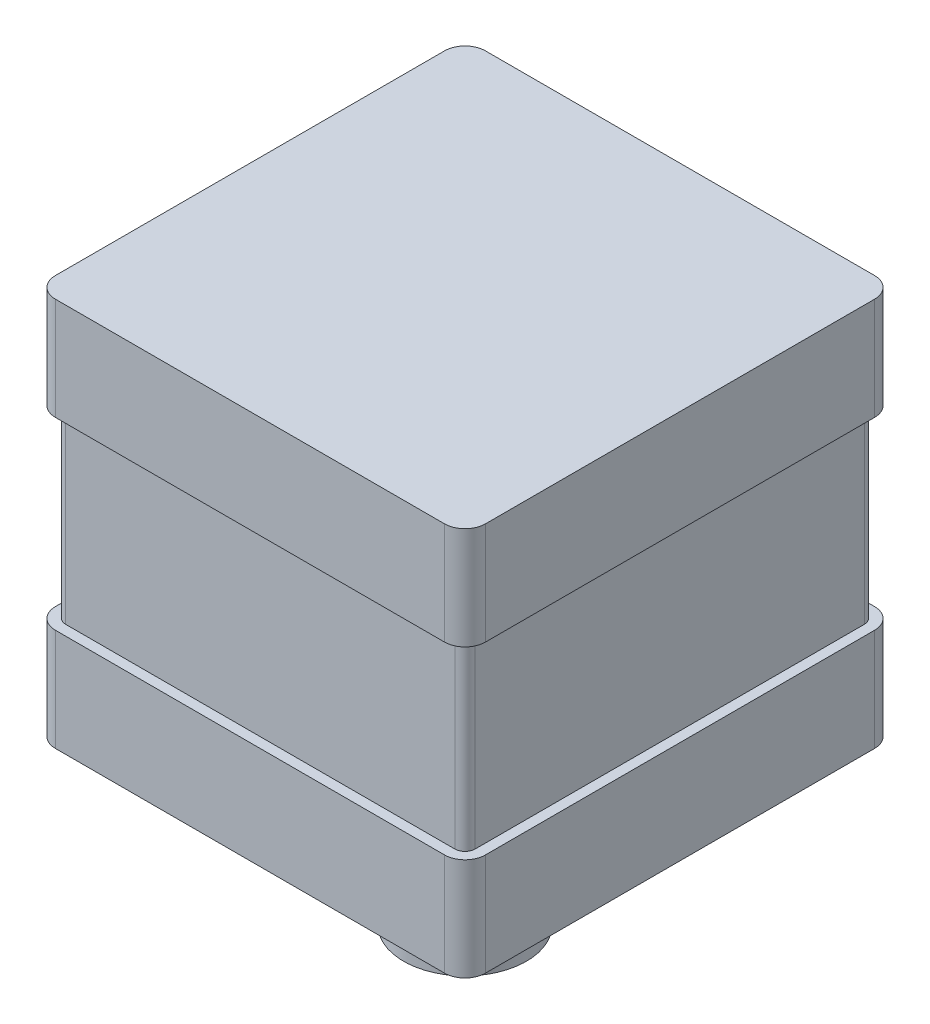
ISO-10303-21;
HEADER;
FILE_DESCRIPTION(('STEP AP214'),'2;1');
FILE_NAME('part.step','',(''),(''),'','','');
FILE_SCHEMA(('AUTOMOTIVE_DESIGN { 1 0 10303 214 1 1 1 1 }'));
ENDSEC;
DATA;
#1=APPLICATION_CONTEXT('core data for automotive mechanical design processes');
#2=APPLICATION_PROTOCOL_DEFINITION('international standard','automotive_design',2000,#1);
#3=PRODUCT_CONTEXT('',#1,'mechanical');
#4=PRODUCT('Part','Part','',(#3));
#5=PRODUCT_RELATED_PRODUCT_CATEGORY('part','',(#4));
#6=PRODUCT_DEFINITION_FORMATION('','',#4);
#7=PRODUCT_DEFINITION_CONTEXT('part definition',#1,'design');
#8=PRODUCT_DEFINITION('design','',#6,#7);
#9=PRODUCT_DEFINITION_SHAPE('','',#8);
#10=(LENGTH_UNIT() NAMED_UNIT(*) SI_UNIT(.MILLI.,.METRE.));
#11=(NAMED_UNIT(*) PLANE_ANGLE_UNIT() SI_UNIT($,.RADIAN.));
#12=(NAMED_UNIT(*) SI_UNIT($,.STERADIAN.) SOLID_ANGLE_UNIT());
#13=UNCERTAINTY_MEASURE_WITH_UNIT(LENGTH_MEASURE(1.E-05),#10,'distance_accuracy_value','');
#14=(GEOMETRIC_REPRESENTATION_CONTEXT(3) GLOBAL_UNCERTAINTY_ASSIGNED_CONTEXT((#13)) GLOBAL_UNIT_ASSIGNED_CONTEXT((#10,
#11,#12)) REPRESENTATION_CONTEXT('',''));
#15=CARTESIAN_POINT('',(0.,0.,0.));
#16=DIRECTION('',(0.,0.,1.));
#17=DIRECTION('',(1.,0.,0.));
#18=AXIS2_PLACEMENT_3D('',#15,#16,#17);
#19=CARTESIAN_POINT('',(-19.,10.,-19.));
#20=DIRECTION('',(0.,-1.,0.));
#21=DIRECTION('',(0.,0.,-1.));
#22=AXIS2_PLACEMENT_3D('',#19,#20,#21);
#23=CYLINDRICAL_SURFACE('',#22,2.);
#24=CARTESIAN_POINT('',(-19.,0.,-19.));
#25=DIRECTION('',(0.,1.,0.));
#26=DIRECTION('',(0.,0.,-1.));
#27=AXIS2_PLACEMENT_3D('',#24,#25,#26);
#28=CIRCLE('',#27,2.);
#29=CARTESIAN_POINT('',(-19.,0.,-21.));
#30=VERTEX_POINT('',#29);
#31=CARTESIAN_POINT('',(-21.,0.,-19.));
#32=VERTEX_POINT('',#31);
#33=EDGE_CURVE('E336',#30,#32,#28,.T.);
#34=ORIENTED_EDGE('',*,*,#33,.T.);
#35=DIRECTION('',(0.,-1.,0.));
#36=VECTOR('',#35,1.);
#37=CARTESIAN_POINT('',(-21.,10.,-19.));
#38=LINE('',#37,#36);
#39=CARTESIAN_POINT('',(-21.,10.,-19.));
#40=VERTEX_POINT('',#39);
#41=EDGE_CURVE('E60',#40,#32,#38,.T.);
#42=ORIENTED_EDGE('',*,*,#41,.F.);
#43=CARTESIAN_POINT('',(-19.,10.,-19.));
#44=DIRECTION('',(0.,1.,0.));
#45=DIRECTION('',(0.,0.,-1.));
#46=AXIS2_PLACEMENT_3D('',#43,#44,#45);
#47=CIRCLE('',#46,2.);
#48=CARTESIAN_POINT('',(-19.,10.,-21.));
#49=VERTEX_POINT('',#48);
#50=EDGE_CURVE('E337',#49,#40,#47,.T.);
#51=ORIENTED_EDGE('',*,*,#50,.F.);
#52=DIRECTION('',(0.,-1.,0.));
#53=VECTOR('',#52,1.);
#54=CARTESIAN_POINT('',(-19.,10.,-21.));
#55=LINE('',#54,#53);
#56=EDGE_CURVE('E363',#49,#30,#55,.T.);
#57=ORIENTED_EDGE('',*,*,#56,.T.);
#58=EDGE_LOOP('',(#34,#42,#51,#57));
#59=FACE_BOUND('',#58,.T.);
#60=ADVANCED_FACE('F51',(#59),#23,.T.);
#61=CARTESIAN_POINT('',(-21.,10.,19.));
#62=DIRECTION('',(1.,0.,0.));
#63=DIRECTION('',(0.,0.,-1.));
#64=AXIS2_PLACEMENT_3D('',#61,#62,#63);
#65=PLANE('',#64);
#66=DIRECTION('',(0.,0.,1.));
#67=VECTOR('',#66,1.);
#68=CARTESIAN_POINT('',(-21.,0.,19.));
#69=LINE('',#68,#67);
#70=CARTESIAN_POINT('',(-21.,0.,19.));
#71=VERTEX_POINT('',#70);
#72=EDGE_CURVE('E367',#32,#71,#69,.T.);
#73=ORIENTED_EDGE('',*,*,#72,.T.);
#74=DIRECTION('',(0.,-1.,0.));
#75=VECTOR('',#74,1.);
#76=CARTESIAN_POINT('',(-21.,10.,19.));
#77=LINE('',#76,#75);
#78=CARTESIAN_POINT('',(-21.,10.,19.));
#79=VERTEX_POINT('',#78);
#80=EDGE_CURVE('E410',#79,#71,#77,.T.);
#81=ORIENTED_EDGE('',*,*,#80,.F.);
#82=DIRECTION('',(0.,0.,1.));
#83=VECTOR('',#82,1.);
#84=CARTESIAN_POINT('',(-21.,10.,19.));
#85=LINE('',#84,#83);
#86=EDGE_CURVE('E341',#40,#79,#85,.T.);
#87=ORIENTED_EDGE('',*,*,#86,.F.);
#88=ORIENTED_EDGE('',*,*,#41,.T.);
#89=EDGE_LOOP('',(#73,#81,#87,#88));
#90=FACE_BOUND('',#89,.T.);
#91=ADVANCED_FACE('F418',(#90),#65,.F.);
#92=CARTESIAN_POINT('',(-19.,10.,19.));
#93=DIRECTION('',(0.,-1.,0.));
#94=DIRECTION('',(0.,0.,-1.));
#95=AXIS2_PLACEMENT_3D('',#92,#93,#94);
#96=CYLINDRICAL_SURFACE('',#95,2.);
#97=CARTESIAN_POINT('',(-19.,0.,19.));
#98=DIRECTION('',(0.,1.,0.));
#99=DIRECTION('',(0.,0.,-1.));
#100=AXIS2_PLACEMENT_3D('',#97,#98,#99);
#101=CIRCLE('',#100,2.);
#102=CARTESIAN_POINT('',(-19.,0.,21.));
#103=VERTEX_POINT('',#102);
#104=EDGE_CURVE('E370',#71,#103,#101,.T.);
#105=ORIENTED_EDGE('',*,*,#104,.T.);
#106=DIRECTION('',(0.,-1.,0.));
#107=VECTOR('',#106,1.);
#108=CARTESIAN_POINT('',(-19.,10.,21.));
#109=LINE('',#108,#107);
#110=CARTESIAN_POINT('',(-19.,10.,21.));
#111=VERTEX_POINT('',#110);
#112=EDGE_CURVE('E406',#111,#103,#109,.T.);
#113=ORIENTED_EDGE('',*,*,#112,.F.);
#114=CARTESIAN_POINT('',(-19.,10.,19.));
#115=DIRECTION('',(0.,1.,0.));
#116=DIRECTION('',(0.,0.,-1.));
#117=AXIS2_PLACEMENT_3D('',#114,#115,#116);
#118=CIRCLE('',#117,2.);
#119=EDGE_CURVE('E345',#79,#111,#118,.T.);
#120=ORIENTED_EDGE('',*,*,#119,.F.);
#121=ORIENTED_EDGE('',*,*,#80,.T.);
#122=EDGE_LOOP('',(#105,#113,#120,#121));
#123=FACE_BOUND('',#122,.T.);
#124=ADVANCED_FACE('F433',(#123),#96,.T.);
#125=CARTESIAN_POINT('',(-19.,10.,21.));
#126=DIRECTION('',(0.,0.,-1.));
#127=DIRECTION('',(-1.,0.,0.));
#128=AXIS2_PLACEMENT_3D('',#125,#126,#127);
#129=PLANE('',#128);
#130=DIRECTION('',(1.,0.,0.));
#131=VECTOR('',#130,1.);
#132=CARTESIAN_POINT('',(-19.,0.,21.));
#133=LINE('',#132,#131);
#134=CARTESIAN_POINT('',(19.,0.,21.));
#135=VERTEX_POINT('',#134);
#136=EDGE_CURVE('E373',#103,#135,#133,.T.);
#137=ORIENTED_EDGE('',*,*,#136,.T.);
#138=DIRECTION('',(0.,-1.,0.));
#139=VECTOR('',#138,1.);
#140=CARTESIAN_POINT('',(19.,10.,21.));
#141=LINE('',#140,#139);
#142=CARTESIAN_POINT('',(19.,10.,21.));
#143=VERTEX_POINT('',#142);
#144=EDGE_CURVE('E402',#143,#135,#141,.T.);
#145=ORIENTED_EDGE('',*,*,#144,.F.);
#146=DIRECTION('',(1.,0.,0.));
#147=VECTOR('',#146,1.);
#148=CARTESIAN_POINT('',(-19.,10.,21.));
#149=LINE('',#148,#147);
#150=EDGE_CURVE('E348',#111,#143,#149,.T.);
#151=ORIENTED_EDGE('',*,*,#150,.F.);
#152=ORIENTED_EDGE('',*,*,#112,.T.);
#153=EDGE_LOOP('',(#137,#145,#151,#152));
#154=FACE_BOUND('',#153,.T.);
#155=ADVANCED_FACE('F437',(#154),#129,.F.);
#156=CARTESIAN_POINT('',(19.,10.,19.));
#157=DIRECTION('',(0.,-1.,0.));
#158=DIRECTION('',(0.,0.,-1.));
#159=AXIS2_PLACEMENT_3D('',#156,#157,#158);
#160=CYLINDRICAL_SURFACE('',#159,2.);
#161=CARTESIAN_POINT('',(19.,0.,19.));
#162=DIRECTION('',(0.,1.,0.));
#163=DIRECTION('',(0.,0.,1.));
#164=AXIS2_PLACEMENT_3D('',#161,#162,#163);
#165=CIRCLE('',#164,2.);
#166=CARTESIAN_POINT('',(21.,0.,19.));
#167=VERTEX_POINT('',#166);
#168=EDGE_CURVE('E376',#135,#167,#165,.T.);
#169=ORIENTED_EDGE('',*,*,#168,.T.);
#170=DIRECTION('',(0.,-1.,0.));
#171=VECTOR('',#170,1.);
#172=CARTESIAN_POINT('',(21.,10.,19.));
#173=LINE('',#172,#171);
#174=CARTESIAN_POINT('',(21.,10.,19.));
#175=VERTEX_POINT('',#174);
#176=EDGE_CURVE('E398',#175,#167,#173,.T.);
#177=ORIENTED_EDGE('',*,*,#176,.F.);
#178=CARTESIAN_POINT('',(19.,10.,19.));
#179=DIRECTION('',(0.,1.,0.));
#180=DIRECTION('',(0.,0.,1.));
#181=AXIS2_PLACEMENT_3D('',#178,#179,#180);
#182=CIRCLE('',#181,2.);
#183=EDGE_CURVE('E351',#143,#175,#182,.T.);
#184=ORIENTED_EDGE('',*,*,#183,.F.);
#185=ORIENTED_EDGE('',*,*,#144,.T.);
#186=EDGE_LOOP('',(#169,#177,#184,#185));
#187=FACE_BOUND('',#186,.T.);
#188=ADVANCED_FACE('F456',(#187),#160,.T.);
#189=CARTESIAN_POINT('',(21.,10.,19.));
#190=DIRECTION('',(-1.,0.,0.));
#191=DIRECTION('',(0.,0.,1.));
#192=AXIS2_PLACEMENT_3D('',#189,#190,#191);
#193=PLANE('',#192);
#194=DIRECTION('',(0.,0.,-1.));
#195=VECTOR('',#194,1.);
#196=CARTESIAN_POINT('',(21.,0.,19.));
#197=LINE('',#196,#195);
#198=CARTESIAN_POINT('',(21.,0.,-19.));
#199=VERTEX_POINT('',#198);
#200=EDGE_CURVE('E379',#167,#199,#197,.T.);
#201=ORIENTED_EDGE('',*,*,#200,.T.);
#202=DIRECTION('',(0.,-1.,0.));
#203=VECTOR('',#202,1.);
#204=CARTESIAN_POINT('',(21.,10.,-19.));
#205=LINE('',#204,#203);
#206=CARTESIAN_POINT('',(21.,10.,-19.));
#207=VERTEX_POINT('',#206);
#208=EDGE_CURVE('E394',#207,#199,#205,.T.);
#209=ORIENTED_EDGE('',*,*,#208,.F.);
#210=DIRECTION('',(0.,0.,-1.));
#211=VECTOR('',#210,1.);
#212=CARTESIAN_POINT('',(21.,10.,19.));
#213=LINE('',#212,#211);
#214=EDGE_CURVE('E354',#175,#207,#213,.T.);
#215=ORIENTED_EDGE('',*,*,#214,.F.);
#216=ORIENTED_EDGE('',*,*,#176,.T.);
#217=EDGE_LOOP('',(#201,#209,#215,#216));
#218=FACE_BOUND('',#217,.T.);
#219=ADVANCED_FACE('F453',(#218),#193,.F.);
#220=CARTESIAN_POINT('',(19.,10.,-19.));
#221=DIRECTION('',(0.,-1.,0.));
#222=DIRECTION('',(0.,0.,-1.));
#223=AXIS2_PLACEMENT_3D('',#220,#221,#222);
#224=CYLINDRICAL_SURFACE('',#223,2.);
#225=CARTESIAN_POINT('',(19.,0.,-19.));
#226=DIRECTION('',(0.,1.,0.));
#227=DIRECTION('',(0.,0.,1.));
#228=AXIS2_PLACEMENT_3D('',#225,#226,#227);
#229=CIRCLE('',#228,2.);
#230=CARTESIAN_POINT('',(19.,0.,-21.));
#231=VERTEX_POINT('',#230);
#232=EDGE_CURVE('E382',#199,#231,#229,.T.);
#233=ORIENTED_EDGE('',*,*,#232,.T.);
#234=DIRECTION('',(0.,-1.,0.));
#235=VECTOR('',#234,1.);
#236=CARTESIAN_POINT('',(19.,10.,-21.));
#237=LINE('',#236,#235);
#238=CARTESIAN_POINT('',(19.,10.,-21.));
#239=VERTEX_POINT('',#238);
#240=EDGE_CURVE('E390',#239,#231,#237,.T.);
#241=ORIENTED_EDGE('',*,*,#240,.F.);
#242=CARTESIAN_POINT('',(19.,10.,-19.));
#243=DIRECTION('',(0.,1.,0.));
#244=DIRECTION('',(0.,0.,1.));
#245=AXIS2_PLACEMENT_3D('',#242,#243,#244);
#246=CIRCLE('',#245,2.);
#247=EDGE_CURVE('E357',#207,#239,#246,.T.);
#248=ORIENTED_EDGE('',*,*,#247,.F.);
#249=ORIENTED_EDGE('',*,*,#208,.T.);
#250=EDGE_LOOP('',(#233,#241,#248,#249));
#251=FACE_BOUND('',#250,.T.);
#252=ADVANCED_FACE('F449',(#251),#224,.T.);
#253=CARTESIAN_POINT('',(-19.,10.,-21.));
#254=DIRECTION('',(0.,0.,1.));
#255=DIRECTION('',(1.,0.,0.));
#256=AXIS2_PLACEMENT_3D('',#253,#254,#255);
#257=PLANE('',#256);
#258=DIRECTION('',(-1.,0.,0.));
#259=VECTOR('',#258,1.);
#260=CARTESIAN_POINT('',(-19.,0.,-21.));
#261=LINE('',#260,#259);
#262=EDGE_CURVE('E342',#231,#30,#261,.T.);
#263=ORIENTED_EDGE('',*,*,#262,.T.);
#264=ORIENTED_EDGE('',*,*,#56,.F.);
#265=DIRECTION('',(-1.,0.,0.));
#266=VECTOR('',#265,1.);
#267=CARTESIAN_POINT('',(-19.,10.,-21.));
#268=LINE('',#267,#266);
#269=EDGE_CURVE('E360',#239,#49,#268,.T.);
#270=ORIENTED_EDGE('',*,*,#269,.F.);
#271=ORIENTED_EDGE('',*,*,#240,.T.);
#272=EDGE_LOOP('',(#263,#264,#270,#271));
#273=FACE_BOUND('',#272,.T.);
#274=ADVANCED_FACE('F447',(#273),#257,.F.);
#275=CARTESIAN_POINT('',(-19.,10.,-19.));
#276=DIRECTION('',(0.,-1.,0.));
#277=DIRECTION('',(0.,0.,-1.));
#278=AXIS2_PLACEMENT_3D('',#275,#276,#277);
#279=PLANE('',#278);
#280=ORIENTED_EDGE('',*,*,#50,.T.);
#281=ORIENTED_EDGE('',*,*,#86,.T.);
#282=ORIENTED_EDGE('',*,*,#119,.T.);
#283=ORIENTED_EDGE('',*,*,#150,.T.);
#284=ORIENTED_EDGE('',*,*,#183,.T.);
#285=ORIENTED_EDGE('',*,*,#214,.T.);
#286=ORIENTED_EDGE('',*,*,#247,.T.);
#287=ORIENTED_EDGE('',*,*,#269,.T.);
#288=EDGE_LOOP('',(#280,#281,#282,#283,#284,#285,#286,#287));
#289=FACE_BOUND('',#288,.T.);
#290=ADVANCED_FACE('F441',(#289),#279,.F.);
#291=CARTESIAN_POINT('',(-19.,0.,-19.));
#292=DIRECTION('',(0.,-1.,0.));
#293=DIRECTION('',(0.,0.,-1.));
#294=AXIS2_PLACEMENT_3D('',#291,#292,#293);
#295=PLANE('',#294);
#296=CARTESIAN_POINT('',(-19.,0.,19.));
#297=DIRECTION('',(0.,-1.,0.));
#298=DIRECTION('',(0.,0.,1.));
#299=AXIS2_PLACEMENT_3D('',#296,#297,#298);
#300=CIRCLE('',#299,1.);
#301=CARTESIAN_POINT('',(-19.,0.,20.));
#302=VERTEX_POINT('',#301);
#303=CARTESIAN_POINT('',(-20.,0.,19.));
#304=VERTEX_POINT('',#303);
#305=EDGE_CURVE('E67',#302,#304,#300,.T.);
#306=ORIENTED_EDGE('',*,*,#305,.F.);
#307=DIRECTION('',(-1.,0.,0.));
#308=VECTOR('',#307,1.);
#309=CARTESIAN_POINT('',(-19.,0.,20.));
#310=LINE('',#309,#308);
#311=CARTESIAN_POINT('',(19.,0.,20.));
#312=VERTEX_POINT('',#311);
#313=EDGE_CURVE('E71',#312,#302,#310,.T.);
#314=ORIENTED_EDGE('',*,*,#313,.F.);
#315=CARTESIAN_POINT('',(19.,0.,19.));
#316=DIRECTION('',(0.,-1.,0.));
#317=DIRECTION('',(0.,0.,-1.));
#318=AXIS2_PLACEMENT_3D('',#315,#316,#317);
#319=CIRCLE('',#318,1.);
#320=CARTESIAN_POINT('',(20.,0.,19.));
#321=VERTEX_POINT('',#320);
#322=EDGE_CURVE('E300',#321,#312,#319,.T.);
#323=ORIENTED_EDGE('',*,*,#322,.F.);
#324=DIRECTION('',(0.,0.,1.));
#325=VECTOR('',#324,1.);
#326=CARTESIAN_POINT('',(20.,0.,-19.));
#327=LINE('',#326,#325);
#328=CARTESIAN_POINT('',(20.,0.,-19.));
#329=VERTEX_POINT('',#328);
#330=EDGE_CURVE('E296',#329,#321,#327,.T.);
#331=ORIENTED_EDGE('',*,*,#330,.F.);
#332=CARTESIAN_POINT('',(19.,0.,-19.));
#333=DIRECTION('',(0.,-1.,0.));
#334=DIRECTION('',(0.,0.,-1.));
#335=AXIS2_PLACEMENT_3D('',#332,#333,#334);
#336=CIRCLE('',#335,1.);
#337=CARTESIAN_POINT('',(19.,0.,-20.));
#338=VERTEX_POINT('',#337);
#339=EDGE_CURVE('E292',#338,#329,#336,.T.);
#340=ORIENTED_EDGE('',*,*,#339,.F.);
#341=DIRECTION('',(1.,0.,0.));
#342=VECTOR('',#341,1.);
#343=CARTESIAN_POINT('',(-19.,0.,-20.));
#344=LINE('',#343,#342);
#345=CARTESIAN_POINT('',(-19.,0.,-20.));
#346=VERTEX_POINT('',#345);
#347=EDGE_CURVE('E288',#346,#338,#344,.T.);
#348=ORIENTED_EDGE('',*,*,#347,.F.);
#349=CARTESIAN_POINT('',(-19.,0.,-19.));
#350=DIRECTION('',(0.,-1.,0.));
#351=DIRECTION('',(0.,0.,1.));
#352=AXIS2_PLACEMENT_3D('',#349,#350,#351);
#353=CIRCLE('',#352,1.);
#354=CARTESIAN_POINT('',(-20.,0.,-19.));
#355=VERTEX_POINT('',#354);
#356=EDGE_CURVE('E284',#355,#346,#353,.T.);
#357=ORIENTED_EDGE('',*,*,#356,.F.);
#358=DIRECTION('',(0.,0.,-1.));
#359=VECTOR('',#358,1.);
#360=CARTESIAN_POINT('',(-20.,0.,-19.));
#361=LINE('',#360,#359);
#362=EDGE_CURVE('E242',#304,#355,#361,.T.);
#363=ORIENTED_EDGE('',*,*,#362,.F.);
#364=EDGE_LOOP('',(#306,#314,#323,#331,#340,#348,#357,#363));
#365=FACE_BOUND('',#364,.T.);
#366=ORIENTED_EDGE('',*,*,#33,.F.);
#367=ORIENTED_EDGE('',*,*,#262,.F.);
#368=ORIENTED_EDGE('',*,*,#232,.F.);
#369=ORIENTED_EDGE('',*,*,#200,.F.);
#370=ORIENTED_EDGE('',*,*,#168,.F.);
#371=ORIENTED_EDGE('',*,*,#136,.F.);
#372=ORIENTED_EDGE('',*,*,#104,.F.);
#373=ORIENTED_EDGE('',*,*,#72,.F.);
#374=EDGE_LOOP('',(#366,#367,#368,#369,#370,#371,#372,#373));
#375=FACE_BOUND('',#374,.T.);
#376=ADVANCED_FACE('F426',(#365,#375),#295,.T.);
#377=CARTESIAN_POINT('',(-19.,-18.,19.));
#378=DIRECTION('',(0.,1.,0.));
#379=DIRECTION('',(0.,0.,1.));
#380=AXIS2_PLACEMENT_3D('',#377,#378,#379);
#381=CYLINDRICAL_SURFACE('',#380,1.);
#382=ORIENTED_EDGE('',*,*,#305,.T.);
#383=DIRECTION('',(0.,1.,0.));
#384=VECTOR('',#383,1.);
#385=CARTESIAN_POINT('',(-20.,-18.,19.));
#386=LINE('',#385,#384);
#387=CARTESIAN_POINT('',(-20.,-18.,19.));
#388=VERTEX_POINT('',#387);
#389=EDGE_CURVE('E332',#388,#304,#386,.T.);
#390=ORIENTED_EDGE('',*,*,#389,.F.);
#391=CARTESIAN_POINT('',(-19.,-18.,19.));
#392=DIRECTION('',(0.,-1.,0.));
#393=DIRECTION('',(0.,0.,1.));
#394=AXIS2_PLACEMENT_3D('',#391,#392,#393);
#395=CIRCLE('',#394,1.);
#396=CARTESIAN_POINT('',(-19.,-18.,20.));
#397=VERTEX_POINT('',#396);
#398=EDGE_CURVE('E248',#397,#388,#395,.T.);
#399=ORIENTED_EDGE('',*,*,#398,.F.);
#400=DIRECTION('',(0.,1.,0.));
#401=VECTOR('',#400,1.);
#402=CARTESIAN_POINT('',(-19.,-18.,20.));
#403=LINE('',#402,#401);
#404=EDGE_CURVE('E279',#397,#302,#403,.T.);
#405=ORIENTED_EDGE('',*,*,#404,.T.);
#406=EDGE_LOOP('',(#382,#390,#399,#405));
#407=FACE_BOUND('',#406,.T.);
#408=ADVANCED_FACE('F522',(#407),#381,.T.);
#409=CARTESIAN_POINT('',(-20.,-18.,-19.));
#410=DIRECTION('',(1.,0.,0.));
#411=DIRECTION('',(0.,0.,-1.));
#412=AXIS2_PLACEMENT_3D('',#409,#410,#411);
#413=PLANE('',#412);
#414=ORIENTED_EDGE('',*,*,#362,.T.);
#415=DIRECTION('',(0.,1.,0.));
#416=VECTOR('',#415,1.);
#417=CARTESIAN_POINT('',(-20.,-18.,-19.));
#418=LINE('',#417,#416);
#419=CARTESIAN_POINT('',(-20.,-18.,-19.));
#420=VERTEX_POINT('',#419);
#421=EDGE_CURVE('E328',#420,#355,#418,.T.);
#422=ORIENTED_EDGE('',*,*,#421,.F.);
#423=DIRECTION('',(0.,0.,-1.));
#424=VECTOR('',#423,1.);
#425=CARTESIAN_POINT('',(-20.,-18.,-19.));
#426=LINE('',#425,#424);
#427=EDGE_CURVE('E252',#388,#420,#426,.T.);
#428=ORIENTED_EDGE('',*,*,#427,.F.);
#429=ORIENTED_EDGE('',*,*,#389,.T.);
#430=EDGE_LOOP('',(#414,#422,#428,#429));
#431=FACE_BOUND('',#430,.T.);
#432=ADVANCED_FACE('F531',(#431),#413,.F.);
#433=CARTESIAN_POINT('',(-19.,-18.,-19.));
#434=DIRECTION('',(0.,1.,0.));
#435=DIRECTION('',(0.,0.,1.));
#436=AXIS2_PLACEMENT_3D('',#433,#434,#435);
#437=CYLINDRICAL_SURFACE('',#436,1.);
#438=ORIENTED_EDGE('',*,*,#356,.T.);
#439=DIRECTION('',(0.,1.,0.));
#440=VECTOR('',#439,1.);
#441=CARTESIAN_POINT('',(-19.,-18.,-20.));
#442=LINE('',#441,#440);
#443=CARTESIAN_POINT('',(-19.,-18.,-20.));
#444=VERTEX_POINT('',#443);
#445=EDGE_CURVE('E324',#444,#346,#442,.T.);
#446=ORIENTED_EDGE('',*,*,#445,.F.);
#447=CARTESIAN_POINT('',(-19.,-18.,-19.));
#448=DIRECTION('',(0.,-1.,0.));
#449=DIRECTION('',(0.,0.,1.));
#450=AXIS2_PLACEMENT_3D('',#447,#448,#449);
#451=CIRCLE('',#450,1.);
#452=EDGE_CURVE('E256',#420,#444,#451,.T.);
#453=ORIENTED_EDGE('',*,*,#452,.F.);
#454=ORIENTED_EDGE('',*,*,#421,.T.);
#455=EDGE_LOOP('',(#438,#446,#453,#454));
#456=FACE_BOUND('',#455,.T.);
#457=ADVANCED_FACE('F541',(#456),#437,.T.);
#458=CARTESIAN_POINT('',(-19.,-18.,-20.));
#459=DIRECTION('',(0.,0.,1.));
#460=DIRECTION('',(1.,0.,0.));
#461=AXIS2_PLACEMENT_3D('',#458,#459,#460);
#462=PLANE('',#461);
#463=ORIENTED_EDGE('',*,*,#347,.T.);
#464=DIRECTION('',(0.,1.,0.));
#465=VECTOR('',#464,1.);
#466=CARTESIAN_POINT('',(19.,-18.,-20.));
#467=LINE('',#466,#465);
#468=CARTESIAN_POINT('',(19.,-18.,-20.));
#469=VERTEX_POINT('',#468);
#470=EDGE_CURVE('E320',#469,#338,#467,.T.);
#471=ORIENTED_EDGE('',*,*,#470,.F.);
#472=DIRECTION('',(1.,0.,0.));
#473=VECTOR('',#472,1.);
#474=CARTESIAN_POINT('',(-19.,-18.,-20.));
#475=LINE('',#474,#473);
#476=EDGE_CURVE('E260',#444,#469,#475,.T.);
#477=ORIENTED_EDGE('',*,*,#476,.F.);
#478=ORIENTED_EDGE('',*,*,#445,.T.);
#479=EDGE_LOOP('',(#463,#471,#477,#478));
#480=FACE_BOUND('',#479,.T.);
#481=ADVANCED_FACE('F551',(#480),#462,.F.);
#482=CARTESIAN_POINT('',(19.,-18.,-19.));
#483=DIRECTION('',(0.,1.,0.));
#484=DIRECTION('',(0.,0.,1.));
#485=AXIS2_PLACEMENT_3D('',#482,#483,#484);
#486=CYLINDRICAL_SURFACE('',#485,1.);
#487=ORIENTED_EDGE('',*,*,#339,.T.);
#488=DIRECTION('',(0.,1.,0.));
#489=VECTOR('',#488,1.);
#490=CARTESIAN_POINT('',(20.,-18.,-19.));
#491=LINE('',#490,#489);
#492=CARTESIAN_POINT('',(20.,-18.,-19.));
#493=VERTEX_POINT('',#492);
#494=EDGE_CURVE('E316',#493,#329,#491,.T.);
#495=ORIENTED_EDGE('',*,*,#494,.F.);
#496=CARTESIAN_POINT('',(19.,-18.,-19.));
#497=DIRECTION('',(0.,-1.,0.));
#498=DIRECTION('',(0.,0.,-1.));
#499=AXIS2_PLACEMENT_3D('',#496,#497,#498);
#500=CIRCLE('',#499,1.);
#501=EDGE_CURVE('E264',#469,#493,#500,.T.);
#502=ORIENTED_EDGE('',*,*,#501,.F.);
#503=ORIENTED_EDGE('',*,*,#470,.T.);
#504=EDGE_LOOP('',(#487,#495,#502,#503));
#505=FACE_BOUND('',#504,.T.);
#506=ADVANCED_FACE('F561',(#505),#486,.T.);
#507=CARTESIAN_POINT('',(20.,-18.,-19.));
#508=DIRECTION('',(-1.,0.,0.));
#509=DIRECTION('',(0.,0.,1.));
#510=AXIS2_PLACEMENT_3D('',#507,#508,#509);
#511=PLANE('',#510);
#512=ORIENTED_EDGE('',*,*,#330,.T.);
#513=DIRECTION('',(0.,1.,0.));
#514=VECTOR('',#513,1.);
#515=CARTESIAN_POINT('',(20.,-18.,19.));
#516=LINE('',#515,#514);
#517=CARTESIAN_POINT('',(20.,-18.,19.));
#518=VERTEX_POINT('',#517);
#519=EDGE_CURVE('E312',#518,#321,#516,.T.);
#520=ORIENTED_EDGE('',*,*,#519,.F.);
#521=DIRECTION('',(0.,0.,1.));
#522=VECTOR('',#521,1.);
#523=CARTESIAN_POINT('',(20.,-18.,-19.));
#524=LINE('',#523,#522);
#525=EDGE_CURVE('E268',#493,#518,#524,.T.);
#526=ORIENTED_EDGE('',*,*,#525,.F.);
#527=ORIENTED_EDGE('',*,*,#494,.T.);
#528=EDGE_LOOP('',(#512,#520,#526,#527));
#529=FACE_BOUND('',#528,.T.);
#530=ADVANCED_FACE('F571',(#529),#511,.F.);
#531=CARTESIAN_POINT('',(19.,-18.,19.));
#532=DIRECTION('',(0.,1.,0.));
#533=DIRECTION('',(0.,0.,1.));
#534=AXIS2_PLACEMENT_3D('',#531,#532,#533);
#535=CYLINDRICAL_SURFACE('',#534,1.);
#536=ORIENTED_EDGE('',*,*,#322,.T.);
#537=DIRECTION('',(0.,1.,0.));
#538=VECTOR('',#537,1.);
#539=CARTESIAN_POINT('',(19.,-18.,20.));
#540=LINE('',#539,#538);
#541=CARTESIAN_POINT('',(19.,-18.,20.));
#542=VERTEX_POINT('',#541);
#543=EDGE_CURVE('E308',#542,#312,#540,.T.);
#544=ORIENTED_EDGE('',*,*,#543,.F.);
#545=CARTESIAN_POINT('',(19.,-18.,19.));
#546=DIRECTION('',(0.,-1.,0.));
#547=DIRECTION('',(0.,0.,-1.));
#548=AXIS2_PLACEMENT_3D('',#545,#546,#547);
#549=CIRCLE('',#548,1.);
#550=EDGE_CURVE('E272',#518,#542,#549,.T.);
#551=ORIENTED_EDGE('',*,*,#550,.F.);
#552=ORIENTED_EDGE('',*,*,#519,.T.);
#553=EDGE_LOOP('',(#536,#544,#551,#552));
#554=FACE_BOUND('',#553,.T.);
#555=ADVANCED_FACE('F581',(#554),#535,.T.);
#556=CARTESIAN_POINT('',(-19.,-18.,20.));
#557=DIRECTION('',(0.,0.,-1.));
#558=DIRECTION('',(-1.,0.,0.));
#559=AXIS2_PLACEMENT_3D('',#556,#557,#558);
#560=PLANE('',#559);
#561=ORIENTED_EDGE('',*,*,#313,.T.);
#562=ORIENTED_EDGE('',*,*,#404,.F.);
#563=DIRECTION('',(-1.,0.,0.));
#564=VECTOR('',#563,1.);
#565=CARTESIAN_POINT('',(-19.,-18.,20.));
#566=LINE('',#565,#564);
#567=EDGE_CURVE('E276',#542,#397,#566,.T.);
#568=ORIENTED_EDGE('',*,*,#567,.F.);
#569=ORIENTED_EDGE('',*,*,#543,.T.);
#570=EDGE_LOOP('',(#561,#562,#568,#569));
#571=FACE_BOUND('',#570,.T.);
#572=ADVANCED_FACE('F591',(#571),#560,.F.);
#573=CARTESIAN_POINT('',(-19.,-18.,19.));
#574=DIRECTION('',(0.,-1.,0.));
#575=DIRECTION('',(0.,0.,-1.));
#576=AXIS2_PLACEMENT_3D('',#573,#574,#575);
#577=PLANE('',#576);
#578=CARTESIAN_POINT('',(-19.,-18.,19.));
#579=DIRECTION('',(0.,-1.,0.));
#580=DIRECTION('',(0.,0.,-1.));
#581=AXIS2_PLACEMENT_3D('',#578,#579,#580);
#582=CIRCLE('',#581,2.);
#583=CARTESIAN_POINT('',(-19.,-18.,21.));
#584=VERTEX_POINT('',#583);
#585=CARTESIAN_POINT('',(-21.,-18.,19.));
#586=VERTEX_POINT('',#585);
#587=EDGE_CURVE('E237',#584,#586,#582,.T.);
#588=ORIENTED_EDGE('',*,*,#587,.F.);
#589=DIRECTION('',(-1.,0.,0.));
#590=VECTOR('',#589,1.);
#591=CARTESIAN_POINT('',(19.,-18.,21.));
#592=LINE('',#591,#590);
#593=CARTESIAN_POINT('',(19.,-18.,21.));
#594=VERTEX_POINT('',#593);
#595=EDGE_CURVE('E233',#594,#584,#592,.T.);
#596=ORIENTED_EDGE('',*,*,#595,.F.);
#597=CARTESIAN_POINT('',(19.,-18.,19.));
#598=DIRECTION('',(0.,-1.,0.));
#599=DIRECTION('',(0.,0.,-1.));
#600=AXIS2_PLACEMENT_3D('',#597,#598,#599);
#601=CIRCLE('',#600,2.);
#602=CARTESIAN_POINT('',(21.,-18.,19.));
#603=VERTEX_POINT('',#602);
#604=EDGE_CURVE('E961',#603,#594,#601,.T.);
#605=ORIENTED_EDGE('',*,*,#604,.F.);
#606=DIRECTION('',(0.,0.,1.));
#607=VECTOR('',#606,1.);
#608=CARTESIAN_POINT('',(21.,-18.,-19.));
#609=LINE('',#608,#607);
#610=CARTESIAN_POINT('',(21.,-18.,-19.));
#611=VERTEX_POINT('',#610);
#612=EDGE_CURVE('E958',#611,#603,#609,.T.);
#613=ORIENTED_EDGE('',*,*,#612,.F.);
#614=CARTESIAN_POINT('',(19.,-18.,-19.));
#615=DIRECTION('',(0.,-1.,0.));
#616=DIRECTION('',(0.,0.,-1.));
#617=AXIS2_PLACEMENT_3D('',#614,#615,#616);
#618=CIRCLE('',#617,2.);
#619=CARTESIAN_POINT('',(19.,-18.,-21.));
#620=VERTEX_POINT('',#619);
#621=EDGE_CURVE('E955',#620,#611,#618,.T.);
#622=ORIENTED_EDGE('',*,*,#621,.F.);
#623=DIRECTION('',(1.,0.,0.));
#624=VECTOR('',#623,1.);
#625=CARTESIAN_POINT('',(-19.,-18.,-21.));
#626=LINE('',#625,#624);
#627=CARTESIAN_POINT('',(-19.,-18.,-21.));
#628=VERTEX_POINT('',#627);
#629=EDGE_CURVE('E952',#628,#620,#626,.T.);
#630=ORIENTED_EDGE('',*,*,#629,.F.);
#631=CARTESIAN_POINT('',(-19.,-18.,-19.));
#632=DIRECTION('',(0.,-1.,0.));
#633=DIRECTION('',(0.,0.,-1.));
#634=AXIS2_PLACEMENT_3D('',#631,#632,#633);
#635=CIRCLE('',#634,2.);
#636=CARTESIAN_POINT('',(-21.,-18.,-19.));
#637=VERTEX_POINT('',#636);
#638=EDGE_CURVE('E949',#637,#628,#635,.T.);
#639=ORIENTED_EDGE('',*,*,#638,.F.);
#640=DIRECTION('',(0.,0.,-1.));
#641=VECTOR('',#640,1.);
#642=CARTESIAN_POINT('',(-21.,-18.,19.));
#643=LINE('',#642,#641);
#644=EDGE_CURVE('E946',#586,#637,#643,.T.);
#645=ORIENTED_EDGE('',*,*,#644,.F.);
#646=EDGE_LOOP('',(#588,#596,#605,#613,#622,#630,#639,#645));
#647=FACE_BOUND('',#646,.T.);
#648=ORIENTED_EDGE('',*,*,#567,.T.);
#649=ORIENTED_EDGE('',*,*,#398,.T.);
#650=ORIENTED_EDGE('',*,*,#427,.T.);
#651=ORIENTED_EDGE('',*,*,#452,.T.);
#652=ORIENTED_EDGE('',*,*,#476,.T.);
#653=ORIENTED_EDGE('',*,*,#501,.T.);
#654=ORIENTED_EDGE('',*,*,#525,.T.);
#655=ORIENTED_EDGE('',*,*,#550,.T.);
#656=EDGE_LOOP('',(#648,#649,#650,#651,#652,#653,#654,#655));
#657=FACE_BOUND('',#656,.T.);
#658=ADVANCED_FACE('F601',(#647,#657),#577,.F.);
#659=CARTESIAN_POINT('',(-19.,-28.,19.));
#660=DIRECTION('',(0.,1.,0.));
#661=DIRECTION('',(0.,0.,1.));
#662=AXIS2_PLACEMENT_3D('',#659,#660,#661);
#663=CYLINDRICAL_SURFACE('',#662,2.);
#664=ORIENTED_EDGE('',*,*,#587,.T.);
#665=DIRECTION('',(0.,1.,0.));
#666=VECTOR('',#665,1.);
#667=CARTESIAN_POINT('',(-21.,-28.,19.));
#668=LINE('',#667,#666);
#669=CARTESIAN_POINT('',(-21.,-28.,19.));
#670=VERTEX_POINT('',#669);
#671=EDGE_CURVE('E215',#670,#586,#668,.T.);
#672=ORIENTED_EDGE('',*,*,#671,.F.);
#673=CARTESIAN_POINT('',(-19.,-28.,19.));
#674=DIRECTION('',(0.,-1.,0.));
#675=DIRECTION('',(0.,0.,-1.));
#676=AXIS2_PLACEMENT_3D('',#673,#674,#675);
#677=CIRCLE('',#676,2.);
#678=CARTESIAN_POINT('',(-19.,-28.,21.));
#679=VERTEX_POINT('',#678);
#680=EDGE_CURVE('E223',#679,#670,#677,.T.);
#681=ORIENTED_EDGE('',*,*,#680,.F.);
#682=DIRECTION('',(0.,1.,0.));
#683=VECTOR('',#682,1.);
#684=CARTESIAN_POINT('',(-19.,-28.,21.));
#685=LINE('',#684,#683);
#686=EDGE_CURVE('E943',#679,#584,#685,.T.);
#687=ORIENTED_EDGE('',*,*,#686,.T.);
#688=EDGE_LOOP('',(#664,#672,#681,#687));
#689=FACE_BOUND('',#688,.T.);
#690=ADVANCED_FACE('F235',(#689),#663,.T.);
#691=CARTESIAN_POINT('',(-21.,-28.,19.));
#692=DIRECTION('',(1.,0.,0.));
#693=DIRECTION('',(0.,0.,-1.));
#694=AXIS2_PLACEMENT_3D('',#691,#692,#693);
#695=PLANE('',#694);
#696=ORIENTED_EDGE('',*,*,#644,.T.);
#697=DIRECTION('',(0.,1.,0.));
#698=VECTOR('',#697,1.);
#699=CARTESIAN_POINT('',(-21.,-28.,-19.));
#700=LINE('',#699,#698);
#701=CARTESIAN_POINT('',(-21.,-28.,-19.));
#702=VERTEX_POINT('',#701);
#703=EDGE_CURVE('E218',#702,#637,#700,.T.);
#704=ORIENTED_EDGE('',*,*,#703,.F.);
#705=DIRECTION('',(0.,0.,-1.));
#706=VECTOR('',#705,1.);
#707=CARTESIAN_POINT('',(-21.,-28.,19.));
#708=LINE('',#707,#706);
#709=EDGE_CURVE('E211',#670,#702,#708,.T.);
#710=ORIENTED_EDGE('',*,*,#709,.F.);
#711=ORIENTED_EDGE('',*,*,#671,.T.);
#712=EDGE_LOOP('',(#696,#704,#710,#711));
#713=FACE_BOUND('',#712,.T.);
#714=ADVANCED_FACE('F213',(#713),#695,.F.);
#715=CARTESIAN_POINT('',(-19.,-28.,-19.));
#716=DIRECTION('',(0.,1.,0.));
#717=DIRECTION('',(0.,0.,1.));
#718=AXIS2_PLACEMENT_3D('',#715,#716,#717);
#719=CYLINDRICAL_SURFACE('',#718,2.);
#720=ORIENTED_EDGE('',*,*,#638,.T.);
#721=DIRECTION('',(0.,1.,0.));
#722=VECTOR('',#721,1.);
#723=CARTESIAN_POINT('',(-19.,-28.,-21.));
#724=LINE('',#723,#722);
#725=CARTESIAN_POINT('',(-19.,-28.,-21.));
#726=VERTEX_POINT('',#725);
#727=EDGE_CURVE('E244',#726,#628,#724,.T.);
#728=ORIENTED_EDGE('',*,*,#727,.F.);
#729=CARTESIAN_POINT('',(-19.,-28.,-19.));
#730=DIRECTION('',(0.,-1.,0.));
#731=DIRECTION('',(0.,0.,-1.));
#732=AXIS2_PLACEMENT_3D('',#729,#730,#731);
#733=CIRCLE('',#732,2.);
#734=EDGE_CURVE('E222',#702,#726,#733,.T.);
#735=ORIENTED_EDGE('',*,*,#734,.F.);
#736=ORIENTED_EDGE('',*,*,#703,.T.);
#737=EDGE_LOOP('',(#720,#728,#735,#736));
#738=FACE_BOUND('',#737,.T.);
#739=ADVANCED_FACE('F628',(#738),#719,.T.);
#740=CARTESIAN_POINT('',(-19.,-28.,-21.));
#741=DIRECTION('',(0.,0.,1.));
#742=DIRECTION('',(1.,0.,0.));
#743=AXIS2_PLACEMENT_3D('',#740,#741,#742);
#744=PLANE('',#743);
#745=ORIENTED_EDGE('',*,*,#629,.T.);
#746=DIRECTION('',(0.,1.,0.));
#747=VECTOR('',#746,1.);
#748=CARTESIAN_POINT('',(19.,-28.,-21.));
#749=LINE('',#748,#747);
#750=CARTESIAN_POINT('',(19.,-28.,-21.));
#751=VERTEX_POINT('',#750);
#752=EDGE_CURVE('E980',#751,#620,#749,.T.);
#753=ORIENTED_EDGE('',*,*,#752,.F.);
#754=DIRECTION('',(1.,0.,0.));
#755=VECTOR('',#754,1.);
#756=CARTESIAN_POINT('',(-19.,-28.,-21.));
#757=LINE('',#756,#755);
#758=EDGE_CURVE('E929',#726,#751,#757,.T.);
#759=ORIENTED_EDGE('',*,*,#758,.F.);
#760=ORIENTED_EDGE('',*,*,#727,.T.);
#761=EDGE_LOOP('',(#745,#753,#759,#760));
#762=FACE_BOUND('',#761,.T.);
#763=ADVANCED_FACE('F637',(#762),#744,.F.);
#764=CARTESIAN_POINT('',(19.,-28.,-19.));
#765=DIRECTION('',(0.,1.,0.));
#766=DIRECTION('',(0.,0.,1.));
#767=AXIS2_PLACEMENT_3D('',#764,#765,#766);
#768=CYLINDRICAL_SURFACE('',#767,2.);
#769=ORIENTED_EDGE('',*,*,#621,.T.);
#770=DIRECTION('',(0.,1.,0.));
#771=VECTOR('',#770,1.);
#772=CARTESIAN_POINT('',(21.,-28.,-19.));
#773=LINE('',#772,#771);
#774=CARTESIAN_POINT('',(21.,-28.,-19.));
#775=VERTEX_POINT('',#774);
#776=EDGE_CURVE('E976',#775,#611,#773,.T.);
#777=ORIENTED_EDGE('',*,*,#776,.F.);
#778=CARTESIAN_POINT('',(19.,-28.,-19.));
#779=DIRECTION('',(0.,-1.,0.));
#780=DIRECTION('',(0.,0.,-1.));
#781=AXIS2_PLACEMENT_3D('',#778,#779,#780);
#782=CIRCLE('',#781,2.);
#783=EDGE_CURVE('E932',#751,#775,#782,.T.);
#784=ORIENTED_EDGE('',*,*,#783,.F.);
#785=ORIENTED_EDGE('',*,*,#752,.T.);
#786=EDGE_LOOP('',(#769,#777,#784,#785));
#787=FACE_BOUND('',#786,.T.);
#788=ADVANCED_FACE('F647',(#787),#768,.T.);
#789=CARTESIAN_POINT('',(21.,-28.,-19.));
#790=DIRECTION('',(-1.,0.,0.));
#791=DIRECTION('',(0.,0.,1.));
#792=AXIS2_PLACEMENT_3D('',#789,#790,#791);
#793=PLANE('',#792);
#794=ORIENTED_EDGE('',*,*,#612,.T.);
#795=DIRECTION('',(0.,1.,0.));
#796=VECTOR('',#795,1.);
#797=CARTESIAN_POINT('',(21.,-28.,19.));
#798=LINE('',#797,#796);
#799=CARTESIAN_POINT('',(21.,-28.,19.));
#800=VERTEX_POINT('',#799);
#801=EDGE_CURVE('E972',#800,#603,#798,.T.);
#802=ORIENTED_EDGE('',*,*,#801,.F.);
#803=DIRECTION('',(0.,0.,1.));
#804=VECTOR('',#803,1.);
#805=CARTESIAN_POINT('',(21.,-28.,-19.));
#806=LINE('',#805,#804);
#807=EDGE_CURVE('E935',#775,#800,#806,.T.);
#808=ORIENTED_EDGE('',*,*,#807,.F.);
#809=ORIENTED_EDGE('',*,*,#776,.T.);
#810=EDGE_LOOP('',(#794,#802,#808,#809));
#811=FACE_BOUND('',#810,.T.);
#812=ADVANCED_FACE('F657',(#811),#793,.F.);
#813=CARTESIAN_POINT('',(19.,-28.,19.));
#814=DIRECTION('',(0.,1.,0.));
#815=DIRECTION('',(0.,0.,1.));
#816=AXIS2_PLACEMENT_3D('',#813,#814,#815);
#817=CYLINDRICAL_SURFACE('',#816,2.);
#818=ORIENTED_EDGE('',*,*,#604,.T.);
#819=DIRECTION('',(0.,1.,0.));
#820=VECTOR('',#819,1.);
#821=CARTESIAN_POINT('',(19.,-28.,21.));
#822=LINE('',#821,#820);
#823=CARTESIAN_POINT('',(19.,-28.,21.));
#824=VERTEX_POINT('',#823);
#825=EDGE_CURVE('E968',#824,#594,#822,.T.);
#826=ORIENTED_EDGE('',*,*,#825,.F.);
#827=CARTESIAN_POINT('',(19.,-28.,19.));
#828=DIRECTION('',(0.,-1.,0.));
#829=DIRECTION('',(0.,0.,-1.));
#830=AXIS2_PLACEMENT_3D('',#827,#828,#829);
#831=CIRCLE('',#830,2.);
#832=EDGE_CURVE('E938',#800,#824,#831,.T.);
#833=ORIENTED_EDGE('',*,*,#832,.F.);
#834=ORIENTED_EDGE('',*,*,#801,.T.);
#835=EDGE_LOOP('',(#818,#826,#833,#834));
#836=FACE_BOUND('',#835,.T.);
#837=ADVANCED_FACE('F667',(#836),#817,.T.);
#838=CARTESIAN_POINT('',(19.,-28.,21.));
#839=DIRECTION('',(0.,0.,-1.));
#840=DIRECTION('',(-1.,0.,0.));
#841=AXIS2_PLACEMENT_3D('',#838,#839,#840);
#842=PLANE('',#841);
#843=ORIENTED_EDGE('',*,*,#595,.T.);
#844=ORIENTED_EDGE('',*,*,#686,.F.);
#845=DIRECTION('',(-1.,0.,0.));
#846=VECTOR('',#845,1.);
#847=CARTESIAN_POINT('',(19.,-28.,21.));
#848=LINE('',#847,#846);
#849=EDGE_CURVE('E228',#824,#679,#848,.T.);
#850=ORIENTED_EDGE('',*,*,#849,.F.);
#851=ORIENTED_EDGE('',*,*,#825,.T.);
#852=EDGE_LOOP('',(#843,#844,#850,#851));
#853=FACE_BOUND('',#852,.T.);
#854=ADVANCED_FACE('F677',(#853),#842,.F.);
#855=CARTESIAN_POINT('',(-19.,-28.,19.));
#856=DIRECTION('',(0.,-1.,0.));
#857=DIRECTION('',(0.,0.,-1.));
#858=AXIS2_PLACEMENT_3D('',#855,#856,#857);
#859=PLANE('',#858);
#860=CARTESIAN_POINT('',(0.,-28.,0.));
#861=DIRECTION('',(0.,-1.,0.));
#862=DIRECTION('',(0.,0.,-1.));
#863=AXIS2_PLACEMENT_3D('',#860,#861,#862);
#864=CIRCLE('',#863,3.);
#865=CARTESIAN_POINT('',(0.,-28.,-3.));
#866=VERTEX_POINT('',#865);
#867=EDGE_CURVE('E919',#866,#866,#864,.T.);
#868=ORIENTED_EDGE('',*,*,#867,.F.);
#869=EDGE_LOOP('',(#868));
#870=FACE_BOUND('',#869,.T.);
#871=ORIENTED_EDGE('',*,*,#680,.T.);
#872=ORIENTED_EDGE('',*,*,#709,.T.);
#873=ORIENTED_EDGE('',*,*,#734,.T.);
#874=ORIENTED_EDGE('',*,*,#758,.T.);
#875=ORIENTED_EDGE('',*,*,#783,.T.);
#876=ORIENTED_EDGE('',*,*,#807,.T.);
#877=ORIENTED_EDGE('',*,*,#832,.T.);
#878=ORIENTED_EDGE('',*,*,#849,.T.);
#879=EDGE_LOOP('',(#871,#872,#873,#874,#875,#876,#877,#878));
#880=FACE_BOUND('',#879,.T.);
#881=ADVANCED_FACE('F226',(#870,#880),#859,.T.);
#882=CARTESIAN_POINT('',(0.,-43.,0.));
#883=DIRECTION('',(0.,1.,0.));
#884=DIRECTION('',(0.,0.,1.));
#885=AXIS2_PLACEMENT_3D('',#882,#883,#884);
#886=CYLINDRICAL_SURFACE('',#885,3.);
#887=CARTESIAN_POINT('',(0.,-38.,0.));
#888=DIRECTION('',(0.,1.,0.));
#889=DIRECTION('',(0.,0.,1.));
#890=AXIS2_PLACEMENT_3D('',#887,#888,#889);
#891=CIRCLE('',#890,3.);
#892=CARTESIAN_POINT('',(0.,-38.,3.));
#893=VERTEX_POINT('',#892);
#894=EDGE_CURVE('E54',#893,#893,#891,.T.);
#895=ORIENTED_EDGE('',*,*,#894,.T.);
#896=EDGE_LOOP('',(#895));
#897=FACE_BOUND('',#896,.T.);
#898=ORIENTED_EDGE('',*,*,#867,.T.);
#899=EDGE_LOOP('',(#898));
#900=FACE_BOUND('',#899,.T.);
#901=ADVANCED_FACE('F696',(#897,#900),#886,.T.);
#902=CARTESIAN_POINT('',(0.,-38.,0.));
#903=DIRECTION('',(0.,-1.,0.));
#904=DIRECTION('',(0.,0.,-1.));
#905=AXIS2_PLACEMENT_3D('',#902,#903,#904);
#906=CYLINDRICAL_SURFACE('',#905,6.);
#907=CARTESIAN_POINT('',(0.,-38.,0.));
#908=DIRECTION('',(0.,1.,0.));
#909=DIRECTION('',(0.,0.,1.));
#910=AXIS2_PLACEMENT_3D('',#907,#908,#909);
#911=CIRCLE('',#910,6.);
#912=CARTESIAN_POINT('',(0.,-38.,6.));
#913=VERTEX_POINT('',#912);
#914=EDGE_CURVE('E1016',#913,#913,#911,.T.);
#915=ORIENTED_EDGE('',*,*,#914,.F.);
#916=EDGE_LOOP('',(#915));
#917=FACE_BOUND('',#916,.T.);
#918=CARTESIAN_POINT('',(0.,-39.,0.));
#919=DIRECTION('',(0.,1.,0.));
#920=DIRECTION('',(0.,0.,1.));
#921=AXIS2_PLACEMENT_3D('',#918,#919,#920);
#922=CIRCLE('',#921,6.);
#923=CARTESIAN_POINT('',(0.,-39.,6.));
#924=VERTEX_POINT('',#923);
#925=EDGE_CURVE('E1012',#924,#924,#922,.T.);
#926=ORIENTED_EDGE('',*,*,#925,.T.);
#927=EDGE_LOOP('',(#926));
#928=FACE_BOUND('',#927,.T.);
#929=ADVANCED_FACE('F706',(#917,#928),#906,.T.);
#930=CARTESIAN_POINT('',(0.,-38.,0.));
#931=DIRECTION('',(0.,1.,0.));
#932=DIRECTION('',(0.,0.,1.));
#933=AXIS2_PLACEMENT_3D('',#930,#931,#932);
#934=PLANE('',#933);
#935=ORIENTED_EDGE('',*,*,#894,.F.);
#936=EDGE_LOOP('',(#935));
#937=FACE_BOUND('',#936,.T.);
#938=ORIENTED_EDGE('',*,*,#914,.T.);
#939=EDGE_LOOP('',(#938));
#940=FACE_BOUND('',#939,.T.);
#941=ADVANCED_FACE('F725',(#937,#940),#934,.T.);
#942=CARTESIAN_POINT('',(0.,-39.,0.));
#943=DIRECTION('',(0.,1.,0.));
#944=DIRECTION('',(0.,0.,1.));
#945=AXIS2_PLACEMENT_3D('',#942,#943,#944);
#946=PLANE('',#945);
#947=CARTESIAN_POINT('',(0.,-39.,0.));
#948=DIRECTION('',(0.,1.,0.));
#949=DIRECTION('',(0.,0.,1.));
#950=AXIS2_PLACEMENT_3D('',#947,#948,#949);
#951=CIRCLE('',#950,5.);
#952=CARTESIAN_POINT('',(0.,-39.,5.));
#953=VERTEX_POINT('',#952);
#954=EDGE_CURVE('E915',#953,#953,#951,.T.);
#955=ORIENTED_EDGE('',*,*,#954,.T.);
#956=EDGE_LOOP('',(#955));
#957=FACE_BOUND('',#956,.T.);
#958=ORIENTED_EDGE('',*,*,#925,.F.);
#959=EDGE_LOOP('',(#958));
#960=FACE_BOUND('',#959,.T.);
#961=ADVANCED_FACE('F735',(#957,#960),#946,.F.);
#962=CARTESIAN_POINT('',(0.,-44.,0.));
#963=DIRECTION('',(0.,-1.,0.));
#964=DIRECTION('',(0.,0.,-1.));
#965=AXIS2_PLACEMENT_3D('',#962,#963,#964);
#966=PLANE('',#965);
#967=CARTESIAN_POINT('',(0.,-44.,0.));
#968=DIRECTION('',(0.,-1.,0.));
#969=DIRECTION('',(0.,0.,-1.));
#970=AXIS2_PLACEMENT_3D('',#967,#968,#969);
#971=CIRCLE('',#970,6.);
#972=CARTESIAN_POINT('',(0.,-44.,-6.));
#973=VERTEX_POINT('',#972);
#974=EDGE_CURVE('E909',#973,#973,#971,.T.);
#975=ORIENTED_EDGE('',*,*,#974,.T.);
#976=EDGE_LOOP('',(#975));
#977=FACE_BOUND('',#976,.T.);
#978=ADVANCED_FACE('F743',(#977),#966,.T.);
#979=CARTESIAN_POINT('',(0.,-44.,0.));
#980=DIRECTION('',(0.,1.,0.));
#981=DIRECTION('',(0.,0.,1.));
#982=AXIS2_PLACEMENT_3D('',#979,#980,#981);
#983=CYLINDRICAL_SURFACE('',#982,6.);
#984=ORIENTED_EDGE('',*,*,#974,.F.);
#985=EDGE_LOOP('',(#984));
#986=FACE_BOUND('',#985,.T.);
#987=CARTESIAN_POINT('',(0.,-43.,0.));
#988=DIRECTION('',(0.,-1.,0.));
#989=DIRECTION('',(0.,0.,-1.));
#990=AXIS2_PLACEMENT_3D('',#987,#988,#989);
#991=CIRCLE('',#990,6.);
#992=CARTESIAN_POINT('',(0.,-43.,-6.));
#993=VERTEX_POINT('',#992);
#994=EDGE_CURVE('E912',#993,#993,#991,.T.);
#995=ORIENTED_EDGE('',*,*,#994,.T.);
#996=EDGE_LOOP('',(#995));
#997=FACE_BOUND('',#996,.T.);
#998=ADVANCED_FACE('F762',(#986,#997),#983,.T.);
#999=CARTESIAN_POINT('',(0.,-43.,0.));
#1000=DIRECTION('',(0.,-1.,0.));
#1001=DIRECTION('',(0.,0.,-1.));
#1002=AXIS2_PLACEMENT_3D('',#999,#1000,#1001);
#1003=PLANE('',#1002);
#1004=CARTESIAN_POINT('',(0.,-43.,0.));
#1005=DIRECTION('',(0.,-1.,0.));
#1006=DIRECTION('',(0.,0.,-1.));
#1007=AXIS2_PLACEMENT_3D('',#1004,#1005,#1006);
#1008=CIRCLE('',#1007,5.);
#1009=CARTESIAN_POINT('',(0.,-43.,-5.));
#1010=VERTEX_POINT('',#1009);
#1011=EDGE_CURVE('E11',#1010,#1010,#1008,.F.);
#1012=ORIENTED_EDGE('',*,*,#1011,.F.);
#1013=EDGE_LOOP('',(#1012));
#1014=FACE_BOUND('',#1013,.T.);
#1015=ORIENTED_EDGE('',*,*,#994,.F.);
#1016=EDGE_LOOP('',(#1015));
#1017=FACE_BOUND('',#1016,.T.);
#1018=ADVANCED_FACE('F718',(#1014,#1017),#1003,.F.);
#1019=CARTESIAN_POINT('',(0.,-39.,0.));
#1020=DIRECTION('',(0.,-1.,0.));
#1021=DIRECTION('',(0.,0.,-1.));
#1022=AXIS2_PLACEMENT_3D('',#1019,#1020,#1021);
#1023=CYLINDRICAL_SURFACE('',#1022,5.);
#1024=ORIENTED_EDGE('',*,*,#954,.F.);
#1025=EDGE_LOOP('',(#1024));
#1026=FACE_BOUND('',#1025,.T.);
#1027=ORIENTED_EDGE('',*,*,#1011,.T.);
#1028=EDGE_LOOP('',(#1027));
#1029=FACE_BOUND('',#1028,.T.);
#1030=ADVANCED_FACE('F753',(#1026,#1029),#1023,.T.);
#1031=CLOSED_SHELL('',(#60,#91,#124,#155,#188,#219,#252,#274,#290,#376,#408,#432,#457,#481,#506,
#530,#555,#572,#658,#690,#714,#739,#763,#788,#812,#837,#854,#881,#901,#929,#941,#961,#978,#998,
#1018,#1030));
#1032=MANIFOLD_SOLID_BREP('B2',#1031);
#1033=ADVANCED_BREP_SHAPE_REPRESENTATION('',(#18,#1032),#14);
#1034=SHAPE_DEFINITION_REPRESENTATION(#9,#1033);
ENDSEC;
END-ISO-10303-21;
